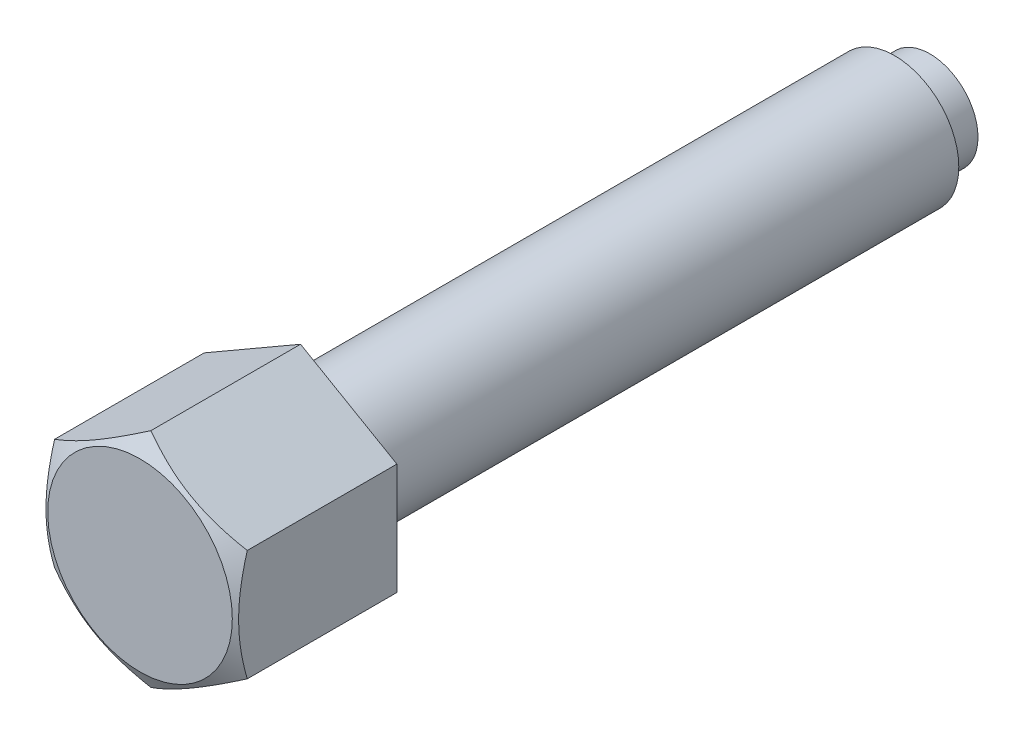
ISO-10303-21;
HEADER;
FILE_DESCRIPTION(('STEP AP214'),'2;1');
FILE_NAME('part.step','',(''),(''),'','','');
FILE_SCHEMA(('AUTOMOTIVE_DESIGN { 1 0 10303 214 1 1 1 1 }'));
ENDSEC;
DATA;
#1=APPLICATION_CONTEXT('core data for automotive mechanical design processes');
#2=APPLICATION_PROTOCOL_DEFINITION('international standard','automotive_design',2000,#1);
#3=PRODUCT_CONTEXT('',#1,'mechanical');
#4=PRODUCT('Part','Part','',(#3));
#5=PRODUCT_RELATED_PRODUCT_CATEGORY('part','',(#4));
#6=PRODUCT_DEFINITION_FORMATION('','',#4);
#7=PRODUCT_DEFINITION_CONTEXT('part definition',#1,'design');
#8=PRODUCT_DEFINITION('design','',#6,#7);
#9=PRODUCT_DEFINITION_SHAPE('','',#8);
#10=(LENGTH_UNIT() NAMED_UNIT(*) SI_UNIT(.MILLI.,.METRE.));
#11=(NAMED_UNIT(*) PLANE_ANGLE_UNIT() SI_UNIT($,.RADIAN.));
#12=(NAMED_UNIT(*) SI_UNIT($,.STERADIAN.) SOLID_ANGLE_UNIT());
#13=UNCERTAINTY_MEASURE_WITH_UNIT(LENGTH_MEASURE(1.E-05),#10,'distance_accuracy_value','');
#14=(GEOMETRIC_REPRESENTATION_CONTEXT(3) GLOBAL_UNCERTAINTY_ASSIGNED_CONTEXT((#13)) GLOBAL_UNIT_ASSIGNED_CONTEXT((#10,
#11,#12)) REPRESENTATION_CONTEXT('',''));
#15=CARTESIAN_POINT('',(0.,0.,0.));
#16=DIRECTION('',(0.,0.,1.));
#17=DIRECTION('',(1.,0.,0.));
#18=AXIS2_PLACEMENT_3D('',#15,#16,#17);
#19=CARTESIAN_POINT('',(0.,13.856406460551,80.));
#20=DIRECTION('',(-0.5,-0.86602540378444,0.));
#21=DIRECTION('',(0.86602540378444,-0.5,0.));
#22=AXIS2_PLACEMENT_3D('',#19,#20,#21);
#23=PLANE('',#22);
#24=CARTESIAN_POINT('',(12.0002,6.92808776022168,98.6394614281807));
#25=CARTESIAN_POINT('',(11.7364142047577,7.0803845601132,98.7273752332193));
#26=CARTESIAN_POINT('',(11.4716448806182,7.23324920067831,98.8112988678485));
#27=CARTESIAN_POINT('',(10.9399829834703,7.5402043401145,98.9700586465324));
#28=CARTESIAN_POINT('',(10.6730897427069,7.69429522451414,99.0448918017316));
#29=CARTESIAN_POINT('',(9.86810959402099,8.15905073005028,99.254307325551));
#30=CARTESIAN_POINT('',(9.3268449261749,8.47155003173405,99.3734216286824));
#31=CARTESIAN_POINT('',(8.516867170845,8.93919090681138,99.5130938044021));
#32=CARTESIAN_POINT('',(8.25057389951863,9.09293539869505,99.5528810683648));
#33=CARTESIAN_POINT('',(7.71675440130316,9.40113622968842,99.6196014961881));
#34=CARTESIAN_POINT('',(7.44922815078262,9.55559258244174,99.6465344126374));
#35=CARTESIAN_POINT('',(6.91372963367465,9.86476279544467,99.6868562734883));
#36=CARTESIAN_POINT('',(6.64575827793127,10.0194761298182,99.7002613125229));
#37=CARTESIAN_POINT('',(6.10956726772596,10.3290461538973,99.713241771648));
#38=CARTESIAN_POINT('',(5.84134762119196,10.4839028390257,99.7128176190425));
#39=CARTESIAN_POINT('',(5.3399106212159,10.7734076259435,99.6991048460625));
#40=CARTESIAN_POINT('',(5.10665750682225,10.908076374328,99.6874888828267));
#41=CARTESIAN_POINT('',(4.64068775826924,11.1771041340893,99.6540168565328));
#42=CARTESIAN_POINT('',(4.40797116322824,11.3114631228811,99.632160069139));
#43=CARTESIAN_POINT('',(3.94320092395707,11.5797983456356,99.5785874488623));
#44=CARTESIAN_POINT('',(3.71114798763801,11.7137741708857,99.5468634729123));
#45=CARTESIAN_POINT('',(3.24813003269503,11.9810977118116,99.4741130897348));
#46=CARTESIAN_POINT('',(3.01716508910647,12.1144453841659,99.433086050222));
#47=CARTESIAN_POINT('',(2.31605804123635,12.5192297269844,99.2950132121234));
#48=CARTESIAN_POINT('',(1.84794625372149,12.789494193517,99.1841999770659));
#49=CARTESIAN_POINT('',(0.918702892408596,13.3259930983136,98.9326990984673));
#50=CARTESIAN_POINT('',(0.457559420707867,13.5922344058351,98.7920705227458));
#51=CARTESIAN_POINT('',(-0.000199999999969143,13.8565219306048,98.6394614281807));
#52=B_SPLINE_CURVE_WITH_KNOTS('',3,(#24,#25,#26,#27,#28,#29,#30,#31,#32,#33,#34,#35,#36,#37,#38,
#39,#40,#41,#42,#43,#44,#45,#46,#47,#48,#49,#50,#51),.UNSPECIFIED.,.F.,.F.,(4,2,2,2,2,2,2,2,2,2,
2,2,2,4),(0.,0.951004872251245,1.90232158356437,3.80900466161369,4.73894551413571,
5.6689042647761,6.59775529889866,7.52657763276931,8.33514643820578,9.14377244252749,
9.95306755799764,10.7624176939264,12.4167102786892,14.0677556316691),.UNSPECIFIED.);
#53=CARTESIAN_POINT('',(12.,6.92820323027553,98.6395280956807));
#54=VERTEX_POINT('',#53);
#55=CARTESIAN_POINT('',(0.,13.856406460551,98.6395280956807));
#56=VERTEX_POINT('',#55);
#57=EDGE_CURVE('E30',#54,#56,#52,.T.);
#58=ORIENTED_EDGE('',*,*,#57,.F.);
#59=DIRECTION('',(0.,0.,1.));
#60=VECTOR('',#59,1.);
#61=CARTESIAN_POINT('',(12.,6.92820323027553,80.));
#62=LINE('',#61,#60);
#63=CARTESIAN_POINT('',(12.,6.92820323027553,80.));
#64=VERTEX_POINT('',#63);
#65=EDGE_CURVE('E100',#64,#54,#62,.T.);
#66=ORIENTED_EDGE('',*,*,#65,.F.);
#67=DIRECTION('',(0.86602540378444,-0.5,0.));
#68=VECTOR('',#67,1.);
#69=CARTESIAN_POINT('',(0.,13.856406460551,80.));
#70=LINE('',#69,#68);
#71=CARTESIAN_POINT('',(0.,13.856406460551,80.));
#72=VERTEX_POINT('',#71);
#73=EDGE_CURVE('E38',#72,#64,#70,.T.);
#74=ORIENTED_EDGE('',*,*,#73,.F.);
#75=DIRECTION('',(0.,0.,1.));
#76=VECTOR('',#75,1.);
#77=CARTESIAN_POINT('',(0.,13.856406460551,80.));
#78=LINE('',#77,#76);
#79=EDGE_CURVE('E88',#72,#56,#78,.T.);
#80=ORIENTED_EDGE('',*,*,#79,.T.);
#81=EDGE_LOOP('',(#58,#66,#74,#80));
#82=FACE_BOUND('',#81,.T.);
#83=ADVANCED_FACE('F15',(#82),#23,.F.);
#84=CARTESIAN_POINT('',(12.,6.92820323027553,80.));
#85=DIRECTION('',(-1.,0.,0.));
#86=DIRECTION('',(0.,0.,1.));
#87=AXIS2_PLACEMENT_3D('',#84,#85,#86);
#88=PLANE('',#87);
#89=CARTESIAN_POINT('',(12.,-18.5921579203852,93.8636610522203));
#90=CARTESIAN_POINT('',(12.,-18.3301807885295,93.990739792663));
#91=CARTESIAN_POINT('',(12.,-18.0678957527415,94.1171834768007));
#92=CARTESIAN_POINT('',(12.,-17.5426456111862,94.3686568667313));
#93=CARTESIAN_POINT('',(12.,-17.279680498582,94.4936865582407));
#94=CARTESIAN_POINT('',(12.,-16.4895983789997,94.86647191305));
#95=CARTESIAN_POINT('',(12.,-15.9613723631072,95.1118860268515));
#96=CARTESIAN_POINT('',(12.,-14.898496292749,95.5963077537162));
#97=CARTESIAN_POINT('',(12.,-14.3638269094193,95.8352730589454));
#98=CARTESIAN_POINT('',(12.,-13.2902298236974,96.3034042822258));
#99=CARTESIAN_POINT('',(12.,-12.7513023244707,96.5325706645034));
#100=CARTESIAN_POINT('',(12.,-11.6510124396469,96.9856419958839));
#101=CARTESIAN_POINT('',(12.,-11.0894835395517,97.2091446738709));
#102=CARTESIAN_POINT('',(12.,-9.95984566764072,97.6391920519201));
#103=CARTESIAN_POINT('',(12.,-9.39173596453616,97.8457348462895));
#104=CARTESIAN_POINT('',(12.,-8.249120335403,98.2364242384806));
#105=CARTESIAN_POINT('',(12.,-7.67463008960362,98.4206163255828));
#106=CARTESIAN_POINT('',(12.,-6.51735438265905,98.7606923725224));
#107=CARTESIAN_POINT('',(12.,-5.93457160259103,98.916585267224));
#108=CARTESIAN_POINT('',(12.,-5.05568620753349,99.1231251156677));
#109=CARTESIAN_POINT('',(12.,-4.76273964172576,99.1872844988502));
#110=CARTESIAN_POINT('',(12.,-4.17484817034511,99.3057368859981));
#111=CARTESIAN_POINT('',(12.,-3.87990330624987,99.3600300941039));
#112=CARTESIAN_POINT('',(12.,-3.28821973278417,99.4577906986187));
#113=CARTESIAN_POINT('',(12.,-2.99148104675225,99.501258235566));
#114=CARTESIAN_POINT('',(12.,-2.39652599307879,99.576499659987));
#115=CARTESIAN_POINT('',(12.,-2.09830968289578,99.6082739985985));
#116=CARTESIAN_POINT('',(12.,-1.50470226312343,99.6591004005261));
#117=CARTESIAN_POINT('',(12.,-1.20932496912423,99.6783128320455));
#118=CARTESIAN_POINT('',(12.,-0.618023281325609,99.7042305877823));
#119=CARTESIAN_POINT('',(12.,-0.322098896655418,99.710936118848));
#120=CARTESIAN_POINT('',(12.,0.269769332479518,99.7116806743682));
#121=CARTESIAN_POINT('',(12.,0.565713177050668,99.7057196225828));
#122=CARTESIAN_POINT('',(12.,1.15708681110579,99.6812760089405));
#123=CARTESIAN_POINT('',(12.,1.45251657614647,99.6627928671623));
#124=CARTESIAN_POINT('',(12.,2.16305433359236,99.6036714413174));
#125=CARTESIAN_POINT('',(12.,2.57767422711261,99.5570626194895));
#126=CARTESIAN_POINT('',(12.,3.40382765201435,99.4417232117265));
#127=CARTESIAN_POINT('',(12.,3.8153607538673,99.3729896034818));
#128=CARTESIAN_POINT('',(12.,4.63495097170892,99.2158457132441));
#129=CARTESIAN_POINT('',(12.,5.04300511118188,99.1274200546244));
#130=CARTESIAN_POINT('',(12.,5.85501565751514,98.9335892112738));
#131=CARTESIAN_POINT('',(12.,6.25897212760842,98.8281842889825));
#132=CARTESIAN_POINT('',(12.,7.07168470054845,98.6004633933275));
#133=CARTESIAN_POINT('',(12.,7.48034999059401,98.4778255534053));
#134=CARTESIAN_POINT('',(12.,8.29365439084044,98.2199237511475));
#135=CARTESIAN_POINT('',(12.,8.69829347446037,98.0846597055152));
#136=CARTESIAN_POINT('',(12.,9.50374650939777,97.8036493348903));
#137=CARTESIAN_POINT('',(12.,9.904561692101,97.6579065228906));
#138=CARTESIAN_POINT('',(12.,10.7028734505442,97.3576488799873));
#139=CARTESIAN_POINT('',(12.,11.1003700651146,97.2031341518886));
#140=CARTESIAN_POINT('',(12.,12.0383894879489,96.82848959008));
#141=CARTESIAN_POINT('',(12.,12.5776341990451,96.6051645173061));
#142=CARTESIAN_POINT('',(12.,13.6515441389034,96.147731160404));
#143=CARTESIAN_POINT('',(12.,14.1862090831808,95.9136222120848));
#144=CARTESIAN_POINT('',(12.,15.2518139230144,95.4367830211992));
#145=CARTESIAN_POINT('',(12.,15.782752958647,95.1940508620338));
#146=CARTESIAN_POINT('',(12.,16.8414096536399,94.7017065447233));
#147=CARTESIAN_POINT('',(12.,17.3691273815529,94.4520945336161));
#148=CARTESIAN_POINT('',(12.,18.422452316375,93.947002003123));
#149=CARTESIAN_POINT('',(12.,18.9480565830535,93.6915153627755));
#150=CARTESIAN_POINT('',(12.,19.9970035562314,93.175941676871));
#151=CARTESIAN_POINT('',(12.,20.5203462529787,92.915854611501));
#152=CARTESIAN_POINT('',(12.,21.5650506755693,92.3919029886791));
#153=CARTESIAN_POINT('',(12.,22.0864126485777,92.1280389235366));
#154=CARTESIAN_POINT('',(12.,23.1275096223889,91.5971186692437));
#155=CARTESIAN_POINT('',(12.,23.6472446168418,91.3300624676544));
#156=CARTESIAN_POINT('',(12.,25.1172313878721,90.5699313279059));
#157=CARTESIAN_POINT('',(12.,26.0658494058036,90.0736969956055));
#158=CARTESIAN_POINT('',(12.,27.959571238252,89.0745027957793));
#159=CARTESIAN_POINT('',(12.,28.9046749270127,88.5715426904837));
#160=CARTESIAN_POINT('',(12.,30.7897794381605,87.5617291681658));
#161=CARTESIAN_POINT('',(12.,31.7297871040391,87.0548885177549));
#162=CARTESIAN_POINT('',(12.,33.1381412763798,86.2916343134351));
#163=CARTESIAN_POINT('',(12.,33.6073038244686,86.0367242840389));
#164=CARTESIAN_POINT('',(12.,34.5451390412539,85.5260062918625));
#165=CARTESIAN_POINT('',(12.,35.0138117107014,85.2701983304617));
#166=CARTESIAN_POINT('',(12.,35.4822671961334,85.0139931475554));
#167=B_SPLINE_CURVE_WITH_KNOTS('',3,(#89,#90,#91,#92,#93,#94,#95,#96,#97,#98,#99,#100,#101,#102,
#103,#104,#105,#106,#107,#108,#109,#110,#111,#112,#113,#114,#115,#116,#117,#118,#119,#120,#121,
#122,#123,#124,#125,#126,#127,#128,#129,#130,#131,#132,#133,#134,#135,#136,#137,#138,#139,#140,
#141,#142,#143,#144,#145,#146,#147,#148,#149,#150,#151,#152,#153,#154,#155,#156,#157,#158,#159,
#160,#161,#162,#163,#164,#165,#166),.UNSPECIFIED.,.F.,.F.,(4,2,2,2,2,2,2,2,2,2,2,2,2,2,2,2,2,2,
2,2,2,2,2,2,2,2,2,2,2,2,2,2,2,2,2,2,2,2,4),(0.,0.873513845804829,1.7470365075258,
3.49434127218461,5.25118865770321,7.00795271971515,8.82086610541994,10.6339829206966,
12.4433453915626,14.2521355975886,15.1516668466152,16.0511794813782,16.9506804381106,
17.850146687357,18.7378935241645,19.6256256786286,20.5133631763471,21.4011417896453,
22.6521434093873,23.9033159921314,25.1554690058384,26.407602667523,27.6873689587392,
28.9671436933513,30.2464913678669,31.5258240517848,33.2766444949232,35.0275729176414,
36.778892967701,38.5301756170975,40.2833740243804,42.0365799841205,43.7895594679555,
45.5425457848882,48.7542212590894,51.9660105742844,55.1698257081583,56.7716469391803,
58.3734657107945),.UNSPECIFIED.);
#168=CARTESIAN_POINT('',(12.,-6.92820323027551,98.6395280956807));
#169=VERTEX_POINT('',#168);
#170=EDGE_CURVE('E147',#169,#54,#167,.T.);
#171=ORIENTED_EDGE('',*,*,#170,.F.);
#172=DIRECTION('',(0.,0.,1.));
#173=VECTOR('',#172,1.);
#174=CARTESIAN_POINT('',(12.,-6.9282032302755,80.));
#175=LINE('',#174,#173);
#176=CARTESIAN_POINT('',(12.,-6.9282032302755,80.));
#177=VERTEX_POINT('',#176);
#178=EDGE_CURVE('E97',#177,#169,#175,.T.);
#179=ORIENTED_EDGE('',*,*,#178,.F.);
#180=DIRECTION('',(0.,-1.,0.));
#181=VECTOR('',#180,1.);
#182=CARTESIAN_POINT('',(12.,6.92820323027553,80.));
#183=LINE('',#182,#181);
#184=EDGE_CURVE('E162',#64,#177,#183,.T.);
#185=ORIENTED_EDGE('',*,*,#184,.F.);
#186=ORIENTED_EDGE('',*,*,#65,.T.);
#187=EDGE_LOOP('',(#171,#179,#185,#186));
#188=FACE_BOUND('',#187,.T.);
#189=ADVANCED_FACE('F126',(#188),#88,.F.);
#190=CARTESIAN_POINT('',(0.,-13.856406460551,80.));
#191=DIRECTION('',(0.5,-0.866025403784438,0.));
#192=DIRECTION('',(0.866025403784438,0.5,0.));
#193=AXIS2_PLACEMENT_3D('',#190,#191,#192);
#194=PLANE('',#193);
#195=ORIENTED_EDGE('',*,*,#178,.T.);
#196=CARTESIAN_POINT('',(12.0002,-6.92808776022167,98.6394614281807));
#197=CARTESIAN_POINT('',(11.7364142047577,-7.08038456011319,98.7273752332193));
#198=CARTESIAN_POINT('',(11.4716448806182,-7.2332492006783,98.8112988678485));
#199=CARTESIAN_POINT('',(10.9399829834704,-7.54020434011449,98.9700586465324));
#200=CARTESIAN_POINT('',(10.6730897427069,-7.69429522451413,99.0448918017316));
#201=CARTESIAN_POINT('',(9.868109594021,-8.15905073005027,99.254307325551));
#202=CARTESIAN_POINT('',(9.32684492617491,-8.47155003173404,99.3734216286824));
#203=CARTESIAN_POINT('',(8.51686717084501,-8.93919090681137,99.5130938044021));
#204=CARTESIAN_POINT('',(8.25057389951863,-9.09293539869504,99.5528810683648));
#205=CARTESIAN_POINT('',(7.71675440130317,-9.40113622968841,99.6196014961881));
#206=CARTESIAN_POINT('',(7.44922815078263,-9.55559258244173,99.6465344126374));
#207=CARTESIAN_POINT('',(6.91372963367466,-9.86476279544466,99.6868562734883));
#208=CARTESIAN_POINT('',(6.64575827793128,-10.0194761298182,99.7002613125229));
#209=CARTESIAN_POINT('',(6.10956726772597,-10.3290461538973,99.713241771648));
#210=CARTESIAN_POINT('',(5.84134762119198,-10.4839028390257,99.7128176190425));
#211=CARTESIAN_POINT('',(5.33991062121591,-10.7734076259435,99.6991048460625));
#212=CARTESIAN_POINT('',(5.10665750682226,-10.908076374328,99.6874888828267));
#213=CARTESIAN_POINT('',(4.64068775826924,-11.1771041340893,99.6540168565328));
#214=CARTESIAN_POINT('',(4.40797116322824,-11.3114631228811,99.632160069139));
#215=CARTESIAN_POINT('',(3.94320092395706,-11.5797983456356,99.5785874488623));
#216=CARTESIAN_POINT('',(3.711147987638,-11.7137741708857,99.5468634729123));
#217=CARTESIAN_POINT('',(3.24813003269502,-11.9810977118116,99.4741130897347));
#218=CARTESIAN_POINT('',(3.01716508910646,-12.1144453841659,99.433086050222));
#219=CARTESIAN_POINT('',(2.31605804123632,-12.5192297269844,99.2950132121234));
#220=CARTESIAN_POINT('',(1.84794625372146,-12.789494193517,99.1841999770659));
#221=CARTESIAN_POINT('',(0.918702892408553,-13.3259930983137,98.9326990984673));
#222=CARTESIAN_POINT('',(0.457559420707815,-13.5922344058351,98.7920705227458));
#223=CARTESIAN_POINT('',(-0.000200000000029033,-13.8565219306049,98.6394614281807));
#224=B_SPLINE_CURVE_WITH_KNOTS('',3,(#196,#197,#198,#199,#200,#201,#202,#203,#204,#205,#206,
#207,#208,#209,#210,#211,#212,#213,#214,#215,#216,#217,#218,#219,#220,#221,#222,#223),
.UNSPECIFIED.,.F.,.F.,(4,2,2,2,2,2,2,2,2,2,2,2,2,4),(0.,0.951004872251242,1.90232158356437,
3.80900466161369,4.7389455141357,5.66890426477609,6.59775529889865,7.52657763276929,
8.33514643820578,9.14377244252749,9.95306755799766,10.7624176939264,12.4167102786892,
14.0677556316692),.UNSPECIFIED.);
#225=CARTESIAN_POINT('',(0.,-13.856406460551,98.6395280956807));
#226=VERTEX_POINT('',#225);
#227=EDGE_CURVE('E173',#169,#226,#224,.T.);
#228=ORIENTED_EDGE('',*,*,#227,.T.);
#229=DIRECTION('',(0.,0.,1.));
#230=VECTOR('',#229,1.);
#231=CARTESIAN_POINT('',(0.,-13.856406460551,80.));
#232=LINE('',#231,#230);
#233=CARTESIAN_POINT('',(0.,-13.856406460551,80.));
#234=VERTEX_POINT('',#233);
#235=EDGE_CURVE('E90',#234,#226,#232,.T.);
#236=ORIENTED_EDGE('',*,*,#235,.F.);
#237=DIRECTION('',(0.866025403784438,0.5,0.));
#238=VECTOR('',#237,1.);
#239=CARTESIAN_POINT('',(0.,-13.856406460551,80.));
#240=LINE('',#239,#238);
#241=EDGE_CURVE('E159',#234,#177,#240,.T.);
#242=ORIENTED_EDGE('',*,*,#241,.T.);
#243=EDGE_LOOP('',(#195,#228,#236,#242));
#244=FACE_BOUND('',#243,.T.);
#245=ADVANCED_FACE('F131',(#244),#194,.T.);
#246=CARTESIAN_POINT('',(0.,-13.856406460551,80.));
#247=DIRECTION('',(0.5,0.866025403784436,0.));
#248=DIRECTION('',(-0.866025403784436,0.5,0.));
#249=AXIS2_PLACEMENT_3D('',#246,#247,#248);
#250=PLANE('',#249);
#251=CARTESIAN_POINT('',(-12.0002,-6.92808776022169,98.6394614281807));
#252=CARTESIAN_POINT('',(-11.7364142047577,-7.08038456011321,98.7273752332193));
#253=CARTESIAN_POINT('',(-11.4716448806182,-7.23324920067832,98.8112988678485));
#254=CARTESIAN_POINT('',(-10.9399829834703,-7.54020434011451,98.9700586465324));
#255=CARTESIAN_POINT('',(-10.6730897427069,-7.69429522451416,99.0448918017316));
#256=CARTESIAN_POINT('',(-9.86810959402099,-8.15905073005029,99.254307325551));
#257=CARTESIAN_POINT('',(-9.32684492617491,-8.47155003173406,99.3734216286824));
#258=CARTESIAN_POINT('',(-8.51686717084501,-8.93919090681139,99.513093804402));
#259=CARTESIAN_POINT('',(-8.25057389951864,-9.09293539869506,99.5528810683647));
#260=CARTESIAN_POINT('',(-7.71675440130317,-9.40113622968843,99.6196014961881));
#261=CARTESIAN_POINT('',(-7.44922815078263,-9.55559258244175,99.6465344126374));
#262=CARTESIAN_POINT('',(-6.91372963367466,-9.86476279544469,99.6868562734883));
#263=CARTESIAN_POINT('',(-6.64575827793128,-10.0194761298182,99.7002613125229));
#264=CARTESIAN_POINT('',(-6.10956726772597,-10.3290461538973,99.713241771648));
#265=CARTESIAN_POINT('',(-5.84134762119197,-10.4839028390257,99.7128176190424));
#266=CARTESIAN_POINT('',(-5.3399106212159,-10.7734076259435,99.6991048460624));
#267=CARTESIAN_POINT('',(-5.10665750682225,-10.908076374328,99.6874888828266));
#268=CARTESIAN_POINT('',(-4.64068775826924,-11.1771041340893,99.6540168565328));
#269=CARTESIAN_POINT('',(-4.40797116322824,-11.3114631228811,99.632160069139));
#270=CARTESIAN_POINT('',(-3.94320092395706,-11.5797983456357,99.5785874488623));
#271=CARTESIAN_POINT('',(-3.71114798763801,-11.7137741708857,99.5468634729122));
#272=CARTESIAN_POINT('',(-3.24813003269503,-11.9810977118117,99.4741130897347));
#273=CARTESIAN_POINT('',(-3.01716508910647,-12.1144453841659,99.433086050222));
#274=CARTESIAN_POINT('',(-2.31605804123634,-12.5192297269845,99.2950132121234));
#275=CARTESIAN_POINT('',(-1.84794625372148,-12.789494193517,99.1841999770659));
#276=CARTESIAN_POINT('',(-0.918702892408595,-13.3259930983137,98.9326990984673));
#277=CARTESIAN_POINT('',(-0.457559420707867,-13.5922344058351,98.7920705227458));
#278=CARTESIAN_POINT('',(0.000199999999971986,-13.8565219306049,98.6394614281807));
#279=B_SPLINE_CURVE_WITH_KNOTS('',3,(#251,#252,#253,#254,#255,#256,#257,#258,#259,#260,#261,
#262,#263,#264,#265,#266,#267,#268,#269,#270,#271,#272,#273,#274,#275,#276,#277,#278),
.UNSPECIFIED.,.F.,.F.,(4,2,2,2,2,2,2,2,2,2,2,2,2,4),(0.,0.95100487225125,1.90232158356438,
3.80900466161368,4.7389455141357,5.66890426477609,6.59775529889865,7.5265776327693,
8.33514643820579,9.14377244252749,9.95306755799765,10.7624176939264,12.4167102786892,
14.0677556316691),.UNSPECIFIED.);
#280=CARTESIAN_POINT('',(-12.,-6.92820323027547,98.6395280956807));
#281=VERTEX_POINT('',#280);
#282=EDGE_CURVE('E82',#281,#226,#279,.T.);
#283=ORIENTED_EDGE('',*,*,#282,.F.);
#284=DIRECTION('',(0.,0.,1.));
#285=VECTOR('',#284,1.);
#286=CARTESIAN_POINT('',(-12.,-6.92820323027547,80.));
#287=LINE('',#286,#285);
#288=CARTESIAN_POINT('',(-12.,-6.92820323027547,80.));
#289=VERTEX_POINT('',#288);
#290=EDGE_CURVE('E81',#289,#281,#287,.T.);
#291=ORIENTED_EDGE('',*,*,#290,.F.);
#292=DIRECTION('',(-0.866025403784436,0.5,0.));
#293=VECTOR('',#292,1.);
#294=CARTESIAN_POINT('',(0.,-13.856406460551,80.));
#295=LINE('',#294,#293);
#296=EDGE_CURVE('E156',#234,#289,#295,.T.);
#297=ORIENTED_EDGE('',*,*,#296,.F.);
#298=ORIENTED_EDGE('',*,*,#235,.T.);
#299=EDGE_LOOP('',(#283,#291,#297,#298));
#300=FACE_BOUND('',#299,.T.);
#301=ADVANCED_FACE('F171',(#300),#250,.F.);
#302=CARTESIAN_POINT('',(-12.,6.92820323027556,80.));
#303=DIRECTION('',(-1.,0.,0.));
#304=DIRECTION('',(0.,0.,1.));
#305=AXIS2_PLACEMENT_3D('',#302,#303,#304);
#306=PLANE('',#305);
#307=ORIENTED_EDGE('',*,*,#290,.T.);
#308=CARTESIAN_POINT('',(-12.,-18.5921579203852,93.8636610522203));
#309=CARTESIAN_POINT('',(-12.,-18.3301807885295,93.990739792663));
#310=CARTESIAN_POINT('',(-12.,-18.0678957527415,94.1171834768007));
#311=CARTESIAN_POINT('',(-12.,-17.5426456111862,94.3686568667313));
#312=CARTESIAN_POINT('',(-12.,-17.279680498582,94.4936865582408));
#313=CARTESIAN_POINT('',(-12.,-16.4895983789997,94.86647191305));
#314=CARTESIAN_POINT('',(-12.,-15.9613723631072,95.1118860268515));
#315=CARTESIAN_POINT('',(-12.,-14.898496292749,95.5963077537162));
#316=CARTESIAN_POINT('',(-12.,-14.3638269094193,95.8352730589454));
#317=CARTESIAN_POINT('',(-12.,-13.2902298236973,96.3034042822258));
#318=CARTESIAN_POINT('',(-12.,-12.7513023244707,96.5325706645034));
#319=CARTESIAN_POINT('',(-12.,-11.6510124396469,96.9856419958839));
#320=CARTESIAN_POINT('',(-12.,-11.0894835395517,97.2091446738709));
#321=CARTESIAN_POINT('',(-12.,-9.95984566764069,97.6391920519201));
#322=CARTESIAN_POINT('',(-12.,-9.39173596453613,97.8457348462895));
#323=CARTESIAN_POINT('',(-12.,-8.24912033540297,98.2364242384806));
#324=CARTESIAN_POINT('',(-12.,-7.67463008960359,98.4206163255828));
#325=CARTESIAN_POINT('',(-12.,-6.51735438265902,98.7606923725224));
#326=CARTESIAN_POINT('',(-12.,-5.934571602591,98.916585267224));
#327=CARTESIAN_POINT('',(-12.,-5.05568620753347,99.1231251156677));
#328=CARTESIAN_POINT('',(-12.,-4.76273964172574,99.1872844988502));
#329=CARTESIAN_POINT('',(-12.,-4.17484817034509,99.3057368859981));
#330=CARTESIAN_POINT('',(-12.,-3.87990330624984,99.3600300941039));
#331=CARTESIAN_POINT('',(-12.,-3.28821973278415,99.4577906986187));
#332=CARTESIAN_POINT('',(-12.,-2.99148104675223,99.5012582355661));
#333=CARTESIAN_POINT('',(-12.,-2.39652599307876,99.576499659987));
#334=CARTESIAN_POINT('',(-12.,-2.09830968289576,99.6082739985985));
#335=CARTESIAN_POINT('',(-12.,-1.50470226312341,99.6591004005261));
#336=CARTESIAN_POINT('',(-12.,-1.2093249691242,99.6783128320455));
#337=CARTESIAN_POINT('',(-12.,-0.618023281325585,99.7042305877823));
#338=CARTESIAN_POINT('',(-12.,-0.322098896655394,99.710936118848));
#339=CARTESIAN_POINT('',(-12.,0.26976933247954,99.7116806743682));
#340=CARTESIAN_POINT('',(-12.,0.565713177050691,99.7057196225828));
#341=CARTESIAN_POINT('',(-12.,1.15708681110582,99.6812760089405));
#342=CARTESIAN_POINT('',(-12.,1.45251657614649,99.6627928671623));
#343=CARTESIAN_POINT('',(-12.,2.16305433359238,99.6036714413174));
#344=CARTESIAN_POINT('',(-12.,2.57767422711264,99.5570626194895));
#345=CARTESIAN_POINT('',(-12.,3.40382765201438,99.4417232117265));
#346=CARTESIAN_POINT('',(-12.,3.81536075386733,99.3729896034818));
#347=CARTESIAN_POINT('',(-12.,4.63495097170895,99.2158457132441));
#348=CARTESIAN_POINT('',(-12.,5.04300511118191,99.1274200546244));
#349=CARTESIAN_POINT('',(-12.,5.85501565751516,98.9335892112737));
#350=CARTESIAN_POINT('',(-12.,6.25897212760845,98.8281842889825));
#351=CARTESIAN_POINT('',(-12.,7.07168470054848,98.6004633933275));
#352=CARTESIAN_POINT('',(-12.,7.48034999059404,98.4778255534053));
#353=CARTESIAN_POINT('',(-12.,8.29365439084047,98.2199237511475));
#354=CARTESIAN_POINT('',(-12.,8.6982934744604,98.0846597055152));
#355=CARTESIAN_POINT('',(-12.,9.5037465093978,97.8036493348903));
#356=CARTESIAN_POINT('',(-12.,9.90456169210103,97.6579065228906));
#357=CARTESIAN_POINT('',(-12.,10.7028734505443,97.3576488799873));
#358=CARTESIAN_POINT('',(-12.,11.1003700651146,97.2031341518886));
#359=CARTESIAN_POINT('',(-12.,12.0383894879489,96.82848959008));
#360=CARTESIAN_POINT('',(-12.,12.5776341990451,96.6051645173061));
#361=CARTESIAN_POINT('',(-12.,13.6515441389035,96.147731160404));
#362=CARTESIAN_POINT('',(-12.,14.1862090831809,95.9136222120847));
#363=CARTESIAN_POINT('',(-12.,15.2518139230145,95.4367830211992));
#364=CARTESIAN_POINT('',(-12.,15.782752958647,95.1940508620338));
#365=CARTESIAN_POINT('',(-12.,16.84140965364,94.7017065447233));
#366=CARTESIAN_POINT('',(-12.,17.3691273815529,94.452094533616));
#367=CARTESIAN_POINT('',(-12.,18.422452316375,93.947002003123));
#368=CARTESIAN_POINT('',(-12.,18.9480565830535,93.6915153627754));
#369=CARTESIAN_POINT('',(-12.,19.9970035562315,93.1759416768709));
#370=CARTESIAN_POINT('',(-12.,20.5203462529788,92.915854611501));
#371=CARTESIAN_POINT('',(-12.,21.5650506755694,92.391902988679));
#372=CARTESIAN_POINT('',(-12.,22.0864126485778,92.1280389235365));
#373=CARTESIAN_POINT('',(-12.,23.127509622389,91.5971186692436));
#374=CARTESIAN_POINT('',(-12.,23.6472446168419,91.3300624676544));
#375=CARTESIAN_POINT('',(-12.,25.1172313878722,90.5699313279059));
#376=CARTESIAN_POINT('',(-12.,26.0658494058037,90.0736969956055));
#377=CARTESIAN_POINT('',(-12.,27.9595712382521,89.0745027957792));
#378=CARTESIAN_POINT('',(-12.,28.9046749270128,88.5715426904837));
#379=CARTESIAN_POINT('',(-12.,30.7897794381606,87.5617291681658));
#380=CARTESIAN_POINT('',(-12.,31.7297871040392,87.0548885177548));
#381=CARTESIAN_POINT('',(-12.,33.1381412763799,86.2916343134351));
#382=CARTESIAN_POINT('',(-12.,33.6073038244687,86.0367242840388));
#383=CARTESIAN_POINT('',(-12.,34.545139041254,85.5260062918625));
#384=CARTESIAN_POINT('',(-12.,35.0138117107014,85.2701983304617));
#385=CARTESIAN_POINT('',(-12.,35.4822671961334,85.0139931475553));
#386=B_SPLINE_CURVE_WITH_KNOTS('',3,(#308,#309,#310,#311,#312,#313,#314,#315,#316,#317,#318,
#319,#320,#321,#322,#323,#324,#325,#326,#327,#328,#329,#330,#331,#332,#333,#334,#335,#336,#337,
#338,#339,#340,#341,#342,#343,#344,#345,#346,#347,#348,#349,#350,#351,#352,#353,#354,#355,#356,
#357,#358,#359,#360,#361,#362,#363,#364,#365,#366,#367,#368,#369,#370,#371,#372,#373,#374,#375,
#376,#377,#378,#379,#380,#381,#382,#383,#384,#385),.UNSPECIFIED.,.F.,.F.,(4,2,2,2,2,2,2,2,2,2,2,
2,2,2,2,2,2,2,2,2,2,2,2,2,2,2,2,2,2,2,2,2,2,2,2,2,2,2,4),(0.,0.873513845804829,1.74703650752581,
3.49434127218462,5.25118865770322,7.00795271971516,8.82086610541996,10.6339829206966,
12.4433453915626,14.2521355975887,15.1516668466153,16.0511794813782,16.9506804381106,
17.850146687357,18.7378935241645,19.6256256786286,20.5133631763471,21.4011417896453,
22.6521434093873,23.9033159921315,25.1554690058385,26.407602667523,27.6873689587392,
28.9671436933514,30.2464913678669,31.5258240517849,33.2766444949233,35.0275729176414,
36.778892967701,38.5301756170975,40.2833740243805,42.0365799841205,43.7895594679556,
45.5425457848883,48.7542212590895,51.9660105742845,55.1698257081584,56.7716469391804,
58.3734657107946),.UNSPECIFIED.);
#387=CARTESIAN_POINT('',(-12.,6.92820323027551,98.6395280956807));
#388=VERTEX_POINT('',#387);
#389=EDGE_CURVE('E69',#281,#388,#386,.T.);
#390=ORIENTED_EDGE('',*,*,#389,.T.);
#391=DIRECTION('',(0.,0.,1.));
#392=VECTOR('',#391,1.);
#393=CARTESIAN_POINT('',(-12.,6.92820323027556,80.));
#394=LINE('',#393,#392);
#395=CARTESIAN_POINT('',(-12.,6.92820323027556,80.));
#396=VERTEX_POINT('',#395);
#397=EDGE_CURVE('E79',#396,#388,#394,.T.);
#398=ORIENTED_EDGE('',*,*,#397,.F.);
#399=DIRECTION('',(0.,-1.,0.));
#400=VECTOR('',#399,1.);
#401=CARTESIAN_POINT('',(-12.,6.92820323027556,80.));
#402=LINE('',#401,#400);
#403=EDGE_CURVE('E154',#396,#289,#402,.T.);
#404=ORIENTED_EDGE('',*,*,#403,.T.);
#405=EDGE_LOOP('',(#307,#390,#398,#404));
#406=FACE_BOUND('',#405,.T.);
#407=ADVANCED_FACE('F77',(#406),#306,.T.);
#408=CARTESIAN_POINT('',(0.,13.856406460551,80.));
#409=DIRECTION('',(-0.5,0.866025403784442,0.));
#410=DIRECTION('',(-0.866025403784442,-0.5,0.));
#411=AXIS2_PLACEMENT_3D('',#408,#409,#410);
#412=PLANE('',#411);
#413=ORIENTED_EDGE('',*,*,#397,.T.);
#414=CARTESIAN_POINT('',(-12.0002,6.92808776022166,98.6394614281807));
#415=CARTESIAN_POINT('',(-11.7364142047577,7.08038456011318,98.7273752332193));
#416=CARTESIAN_POINT('',(-11.4716448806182,7.23324920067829,98.8112988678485));
#417=CARTESIAN_POINT('',(-10.9399829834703,7.54020434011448,98.9700586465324));
#418=CARTESIAN_POINT('',(-10.6730897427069,7.69429522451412,99.0448918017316));
#419=CARTESIAN_POINT('',(-9.868109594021,8.15905073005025,99.2543073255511));
#420=CARTESIAN_POINT('',(-9.3268449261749,8.47155003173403,99.3734216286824));
#421=CARTESIAN_POINT('',(-8.51686717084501,8.93919090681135,99.5130938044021));
#422=CARTESIAN_POINT('',(-8.25057389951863,9.09293539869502,99.5528810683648));
#423=CARTESIAN_POINT('',(-7.71675440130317,9.40113622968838,99.6196014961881));
#424=CARTESIAN_POINT('',(-7.44922815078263,9.55559258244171,99.6465344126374));
#425=CARTESIAN_POINT('',(-6.91372963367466,9.86476279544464,99.6868562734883));
#426=CARTESIAN_POINT('',(-6.64575827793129,10.0194761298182,99.7002613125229));
#427=CARTESIAN_POINT('',(-6.10956726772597,10.3290461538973,99.713241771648));
#428=CARTESIAN_POINT('',(-5.84134762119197,10.4839028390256,99.7128176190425));
#429=CARTESIAN_POINT('',(-5.3399106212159,10.7734076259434,99.6991048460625));
#430=CARTESIAN_POINT('',(-5.10665750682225,10.9080763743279,99.6874888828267));
#431=CARTESIAN_POINT('',(-4.64068775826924,11.1771041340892,99.6540168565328));
#432=CARTESIAN_POINT('',(-4.40797116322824,11.3114631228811,99.632160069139));
#433=CARTESIAN_POINT('',(-3.94320092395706,11.5797983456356,99.5785874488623));
#434=CARTESIAN_POINT('',(-3.711147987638,11.7137741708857,99.5468634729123));
#435=CARTESIAN_POINT('',(-3.24813003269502,11.9810977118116,99.4741130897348));
#436=CARTESIAN_POINT('',(-3.01716508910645,12.1144453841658,99.433086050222));
#437=CARTESIAN_POINT('',(-2.31605804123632,12.5192297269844,99.2950132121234));
#438=CARTESIAN_POINT('',(-1.84794625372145,12.7894941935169,99.1841999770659));
#439=CARTESIAN_POINT('',(-0.918702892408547,13.3259930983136,98.9326990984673));
#440=CARTESIAN_POINT('',(-0.457559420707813,13.5922344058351,98.7920705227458));
#441=CARTESIAN_POINT('',(0.000200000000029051,13.8565219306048,98.6394614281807));
#442=B_SPLINE_CURVE_WITH_KNOTS('',3,(#414,#415,#416,#417,#418,#419,#420,#421,#422,#423,#424,
#425,#426,#427,#428,#429,#430,#431,#432,#433,#434,#435,#436,#437,#438,#439,#440,#441),
.UNSPECIFIED.,.F.,.F.,(4,2,2,2,2,2,2,2,2,2,2,2,2,4),(0.,0.951004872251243,1.90232158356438,
3.80900466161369,4.7389455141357,5.66890426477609,6.59775529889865,7.52657763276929,
8.33514643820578,9.14377244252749,9.95306755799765,10.7624176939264,12.4167102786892,
14.0677556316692),.UNSPECIFIED.);
#443=EDGE_CURVE('E66',#388,#56,#442,.T.);
#444=ORIENTED_EDGE('',*,*,#443,.T.);
#445=ORIENTED_EDGE('',*,*,#79,.F.);
#446=DIRECTION('',(-0.866025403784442,-0.5,0.));
#447=VECTOR('',#446,1.);
#448=CARTESIAN_POINT('',(0.,13.856406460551,80.));
#449=LINE('',#448,#447);
#450=EDGE_CURVE('E86',#72,#396,#449,.T.);
#451=ORIENTED_EDGE('',*,*,#450,.T.);
#452=EDGE_LOOP('',(#413,#444,#445,#451));
#453=FACE_BOUND('',#452,.T.);
#454=ADVANCED_FACE('F84',(#453),#412,.T.);
#455=CARTESIAN_POINT('',(0.,0.,12.));
#456=DIRECTION('',(0.,0.,1.));
#457=DIRECTION('',(1.,0.,0.));
#458=AXIS2_PLACEMENT_3D('',#455,#456,#457);
#459=SPHERICAL_SURFACE('',#458,12.);
#460=CARTESIAN_POINT('',(0.,0.,1.60769515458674));
#461=DIRECTION('',(0.,0.,1.));
#462=DIRECTION('',(1.,0.,0.));
#463=AXIS2_PLACEMENT_3D('',#460,#461,#462);
#464=CIRCLE('',#463,6.);
#465=CARTESIAN_POINT('',(6.,0.,1.60769515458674));
#466=VERTEX_POINT('',#465);
#467=EDGE_CURVE('E9',#466,#466,#464,.T.);
#468=ORIENTED_EDGE('',*,*,#467,.F.);
#469=EDGE_LOOP('',(#468));
#470=FACE_BOUND('',#469,.T.);
#471=ADVANCED_FACE('F17',(#470),#459,.T.);
#472=CARTESIAN_POINT('',(0.,0.,110.));
#473=DIRECTION('',(0.,0.,1.));
#474=DIRECTION('',(1.,0.,0.));
#475=AXIS2_PLACEMENT_3D('',#472,#473,#474);
#476=CYLINDRICAL_SURFACE('',#475,6.);
#477=ORIENTED_EDGE('',*,*,#467,.T.);
#478=EDGE_LOOP('',(#477));
#479=FACE_BOUND('',#478,.T.);
#480=CARTESIAN_POINT('',(0.,0.,6.));
#481=DIRECTION('',(0.,0.,1.));
#482=DIRECTION('',(1.,0.,0.));
#483=AXIS2_PLACEMENT_3D('',#480,#481,#482);
#484=CIRCLE('',#483,6.);
#485=CARTESIAN_POINT('',(6.,0.,6.));
#486=VERTEX_POINT('',#485);
#487=EDGE_CURVE('E23',#486,#486,#484,.T.);
#488=ORIENTED_EDGE('',*,*,#487,.F.);
#489=EDGE_LOOP('',(#488));
#490=FACE_BOUND('',#489,.T.);
#491=ADVANCED_FACE('F113',(#479,#490),#476,.T.);
#492=CARTESIAN_POINT('',(6.,0.,6.));
#493=DIRECTION('',(0.,0.,1.));
#494=DIRECTION('',(1.,0.,0.));
#495=AXIS2_PLACEMENT_3D('',#492,#493,#494);
#496=PLANE('',#495);
#497=CARTESIAN_POINT('',(0.,0.,6.));
#498=DIRECTION('',(0.,0.,1.));
#499=DIRECTION('',(1.,0.,0.));
#500=AXIS2_PLACEMENT_3D('',#497,#498,#499);
#501=CIRCLE('',#500,8.);
#502=CARTESIAN_POINT('',(8.,0.,6.));
#503=VERTEX_POINT('',#502);
#504=EDGE_CURVE('E106',#503,#503,#501,.T.);
#505=ORIENTED_EDGE('',*,*,#504,.F.);
#506=EDGE_LOOP('',(#505));
#507=FACE_BOUND('',#506,.T.);
#508=ORIENTED_EDGE('',*,*,#487,.T.);
#509=EDGE_LOOP('',(#508));
#510=FACE_BOUND('',#509,.T.);
#511=ADVANCED_FACE('F111',(#507,#510),#496,.F.);
#512=CARTESIAN_POINT('',(0.,0.,110.));
#513=DIRECTION('',(0.,0.,1.));
#514=DIRECTION('',(1.,0.,0.));
#515=AXIS2_PLACEMENT_3D('',#512,#513,#514);
#516=CYLINDRICAL_SURFACE('',#515,8.);
#517=CARTESIAN_POINT('',(0.,0.,80.));
#518=DIRECTION('',(0.,0.,1.));
#519=DIRECTION('',(1.,0.,0.));
#520=AXIS2_PLACEMENT_3D('',#517,#518,#519);
#521=CIRCLE('',#520,8.);
#522=CARTESIAN_POINT('',(8.,0.,80.));
#523=VERTEX_POINT('',#522);
#524=EDGE_CURVE('E103',#523,#523,#521,.T.);
#525=ORIENTED_EDGE('',*,*,#524,.F.);
#526=EDGE_LOOP('',(#525));
#527=FACE_BOUND('',#526,.T.);
#528=ORIENTED_EDGE('',*,*,#504,.T.);
#529=EDGE_LOOP('',(#528));
#530=FACE_BOUND('',#529,.T.);
#531=ADVANCED_FACE('F121',(#527,#530),#516,.T.);
#532=CARTESIAN_POINT('',(8.,0.,80.));
#533=DIRECTION('',(0.,0.,1.));
#534=DIRECTION('',(1.,0.,0.));
#535=AXIS2_PLACEMENT_3D('',#532,#533,#534);
#536=PLANE('',#535);
#537=ORIENTED_EDGE('',*,*,#450,.F.);
#538=ORIENTED_EDGE('',*,*,#73,.T.);
#539=ORIENTED_EDGE('',*,*,#184,.T.);
#540=ORIENTED_EDGE('',*,*,#241,.F.);
#541=ORIENTED_EDGE('',*,*,#296,.T.);
#542=ORIENTED_EDGE('',*,*,#403,.F.);
#543=EDGE_LOOP('',(#537,#538,#539,#540,#541,#542));
#544=FACE_BOUND('',#543,.T.);
#545=ORIENTED_EDGE('',*,*,#524,.T.);
#546=EDGE_LOOP('',(#545));
#547=FACE_BOUND('',#546,.T.);
#548=ADVANCED_FACE('F165',(#544,#547),#536,.F.);
#549=CARTESIAN_POINT('',(0.,0.,100.));
#550=DIRECTION('',(0.,0.,-1.));
#551=DIRECTION('',(-1.,0.,0.));
#552=AXIS2_PLACEMENT_3D('',#549,#550,#551);
#553=CONICAL_SURFACE('',#552,11.5,1.04719755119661);
#554=CARTESIAN_POINT('',(0.,0.,100.));
#555=DIRECTION('',(0.,0.,1.));
#556=DIRECTION('',(1.,0.,0.));
#557=AXIS2_PLACEMENT_3D('',#554,#555,#556);
#558=CIRCLE('',#557,11.5);
#559=CARTESIAN_POINT('',(11.5,0.,100.));
#560=VERTEX_POINT('',#559);
#561=EDGE_CURVE('E73',#560,#560,#558,.T.);
#562=ORIENTED_EDGE('',*,*,#561,.F.);
#563=EDGE_LOOP('',(#562));
#564=FACE_BOUND('',#563,.T.);
#565=ORIENTED_EDGE('',*,*,#57,.T.);
#566=ORIENTED_EDGE('',*,*,#443,.F.);
#567=ORIENTED_EDGE('',*,*,#389,.F.);
#568=ORIENTED_EDGE('',*,*,#282,.T.);
#569=ORIENTED_EDGE('',*,*,#227,.F.);
#570=ORIENTED_EDGE('',*,*,#170,.T.);
#571=EDGE_LOOP('',(#565,#566,#567,#568,#569,#570));
#572=FACE_BOUND('',#571,.T.);
#573=ADVANCED_FACE('F68',(#564,#572),#553,.T.);
#574=CARTESIAN_POINT('',(0.,0.,100.));
#575=DIRECTION('',(0.,0.,1.));
#576=DIRECTION('',(1.,0.,0.));
#577=AXIS2_PLACEMENT_3D('',#574,#575,#576);
#578=PLANE('',#577);
#579=ORIENTED_EDGE('',*,*,#561,.T.);
#580=EDGE_LOOP('',(#579));
#581=FACE_BOUND('',#580,.T.);
#582=ADVANCED_FACE('F197',(#581),#578,.T.);
#583=CLOSED_SHELL('',(#83,#189,#245,#301,#407,#454,#471,#491,#511,#531,#548,#573,#582));
#584=MANIFOLD_SOLID_BREP('B1',#583);
#585=ADVANCED_BREP_SHAPE_REPRESENTATION('',(#18,#584),#14);
#586=SHAPE_DEFINITION_REPRESENTATION(#9,#585);
ENDSEC;
END-ISO-10303-21;
